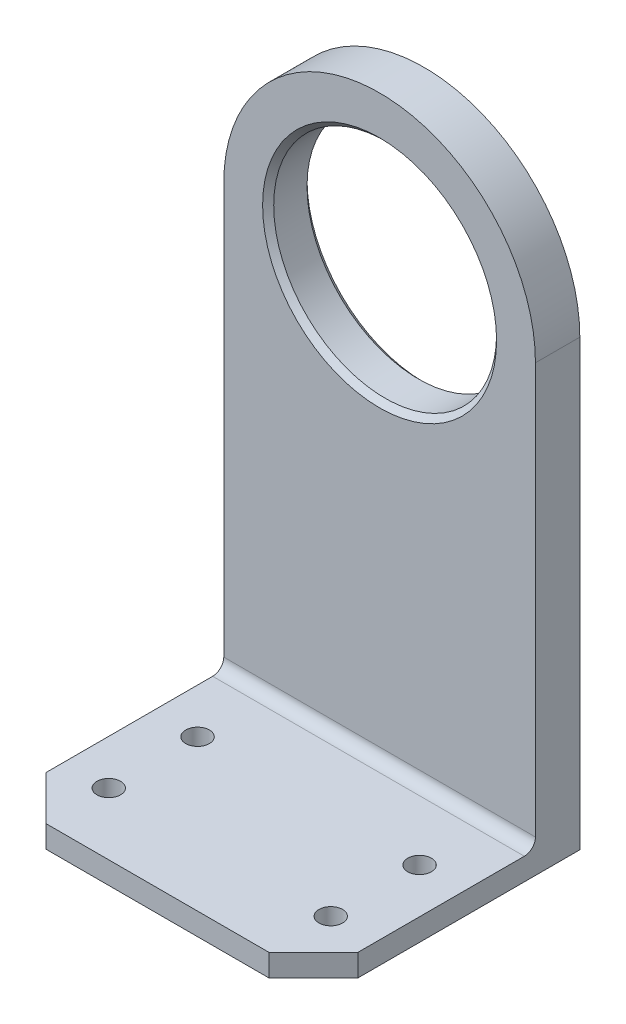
from build123d import *

# Parameters (mm, degrees)
SKETCH1_R          = 31.875
EXTRUDE1_DEPTH     = 12.7
SKETCH2_W          = 89.15
SKETCH2_H          = 6.35
EXTRUDE2_DEPTH     = 63.5
SKETCH3_R          = 3.38582
SKETCH3_R_2        = 3.3782
CUT_EXTRUDE1_DEPTH = 188.330379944
FILLET1_R          = 3.175
CHAMFER1_SIZE      = 12.7
CHAMFER2_SIZE      = 1.5875


with BuildPart() as part:
    # Sketch1 → Extrude1 (new body)
    with BuildSketch(Plane.XY):
        with BuildLine():
            Line((44.575, 0), (44.575, -127))
            Line((44.575, -127), (-44.575, -127))
            Line((-44.575, -127), (-44.575, 0))
            ThreePointArc((-44.575, 0), (0, 44.575), (44.575, 0))
        make_face()
        Circle(SKETCH1_R, mode=Mode.SUBTRACT)
    extrude(amount=EXTRUDE1_DEPTH)

    # Sketch2 → Extrude2 (add)
    with BuildSketch(Plane.XY.offset(12.7)):
        with Locations((0, -123.825)):
            Rectangle(SKETCH2_W, SKETCH2_H)
    extrude(amount=EXTRUDE2_DEPTH)

    # Sketch3 → Cut-Extrude1 (cut, through all)
    with BuildSketch(Plane(origin=(0, -120.65, 0), x_dir=(1, 0, 0), z_dir=(0, 1, 0))):
        with Locations(Location((-31.75, -33.02, 0), (0, 0, 180))):
            Circle(SKETCH3_R)
        with Locations(Location((-31.75, -58.42, 0), (0, 0, 180))):
            Circle(SKETCH3_R_2)
        with Locations((31.75, -33.02)):
            Circle(SKETCH3_R)
        with Locations((31.75, -58.42)):
            Circle(SKETCH3_R_2)
    extrude(amount=-CUT_EXTRUDE1_DEPTH, mode=Mode.SUBTRACT)

    # Fillet1
    fillet1_edges = [part.edges().sort_by_distance(p)[0] for p in [
        (0, -120.65, 12.7),
    ]]
    fillet(fillet1_edges, radius=FILLET1_R)

    # Chamfer1
    chamfer1_edges = [part.edges().sort_by_distance(p)[0] for p in [
        (44.575, -123.825, 76.2),
        (-44.575, -123.825, 76.2),
    ]]
    chamfer(chamfer1_edges, length=CHAMFER1_SIZE)

    # Chamfer2
    chamfer2_edges = [part.edges().sort_by_distance(p)[0] for p in [
        (-31.875, 0, 0),
        (-31.875, 0, 12.7),
    ]]
    chamfer(chamfer2_edges, length=CHAMFER2_SIZE)


solid = part.part
